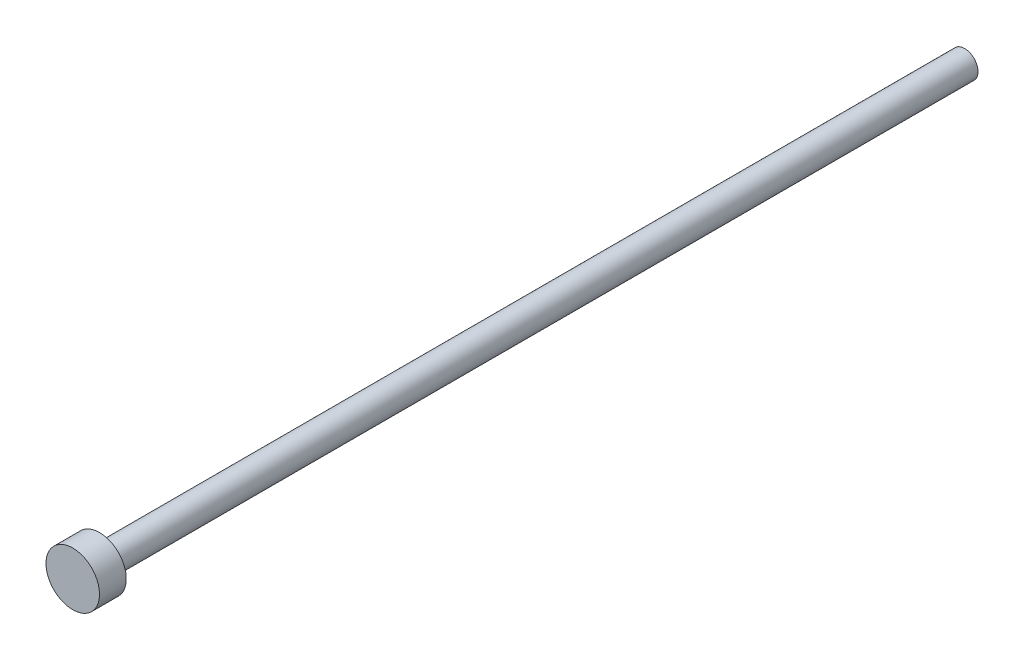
ISO-10303-21;
HEADER;
FILE_DESCRIPTION(('STEP AP214'),'2;1');
FILE_NAME('part.step','',(''),(''),'','','');
FILE_SCHEMA(('AUTOMOTIVE_DESIGN { 1 0 10303 214 1 1 1 1 }'));
ENDSEC;
DATA;
#1=APPLICATION_CONTEXT('core data for automotive mechanical design processes');
#2=APPLICATION_PROTOCOL_DEFINITION('international standard','automotive_design',2000,#1);
#3=PRODUCT_CONTEXT('',#1,'mechanical');
#4=PRODUCT('Part','Part','',(#3));
#5=PRODUCT_RELATED_PRODUCT_CATEGORY('part','',(#4));
#6=PRODUCT_DEFINITION_FORMATION('','',#4);
#7=PRODUCT_DEFINITION_CONTEXT('part definition',#1,'design');
#8=PRODUCT_DEFINITION('design','',#6,#7);
#9=PRODUCT_DEFINITION_SHAPE('','',#8);
#10=(LENGTH_UNIT() NAMED_UNIT(*) SI_UNIT(.MILLI.,.METRE.));
#11=(NAMED_UNIT(*) PLANE_ANGLE_UNIT() SI_UNIT($,.RADIAN.));
#12=(NAMED_UNIT(*) SI_UNIT($,.STERADIAN.) SOLID_ANGLE_UNIT());
#13=UNCERTAINTY_MEASURE_WITH_UNIT(LENGTH_MEASURE(1.E-05),#10,'distance_accuracy_value','');
#14=(GEOMETRIC_REPRESENTATION_CONTEXT(3) GLOBAL_UNCERTAINTY_ASSIGNED_CONTEXT((#13)) GLOBAL_UNIT_ASSIGNED_CONTEXT((#10,
#11,#12)) REPRESENTATION_CONTEXT('',''));
#15=CARTESIAN_POINT('',(0.,0.,0.));
#16=DIRECTION('',(0.,0.,1.));
#17=DIRECTION('',(1.,0.,0.));
#18=AXIS2_PLACEMENT_3D('',#15,#16,#17);
#19=CARTESIAN_POINT('',(0.,1.50000000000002,-100.));
#20=DIRECTION('',(0.,0.,-1.));
#21=DIRECTION('',(-1.,0.,0.));
#22=AXIS2_PLACEMENT_3D('',#19,#20,#21);
#23=PLANE('',#22);
#24=CARTESIAN_POINT('',(0.,0.,-100.));
#25=DIRECTION('',(0.,0.,-1.));
#26=DIRECTION('',(-1.,0.,0.));
#27=AXIS2_PLACEMENT_3D('',#24,#25,#26);
#28=CIRCLE('',#27,1.50000000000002);
#29=CARTESIAN_POINT('',(-1.50000000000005,0.,-100.));
#30=VERTEX_POINT('',#29);
#31=EDGE_CURVE('E10',#30,#30,#28,.T.);
#32=ORIENTED_EDGE('',*,*,#31,.T.);
#33=EDGE_LOOP('',(#32));
#34=FACE_BOUND('',#33,.T.);
#35=ADVANCED_FACE('F32',(#34),#23,.T.);
#36=CARTESIAN_POINT('',(0.,0.,0.));
#37=DIRECTION('',(0.,0.,-1.));
#38=DIRECTION('',(-1.,0.,0.));
#39=AXIS2_PLACEMENT_3D('',#36,#37,#38);
#40=CYLINDRICAL_SURFACE('',#39,1.50000000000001);
#41=CARTESIAN_POINT('',(0.,0.,-3.3));
#42=DIRECTION('',(0.,0.,-1.));
#43=DIRECTION('',(-1.,0.,0.));
#44=AXIS2_PLACEMENT_3D('',#41,#42,#43);
#45=CIRCLE('',#44,1.5);
#46=CARTESIAN_POINT('',(-1.50000000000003,0.,-3.3));
#47=VERTEX_POINT('',#46);
#48=EDGE_CURVE('E38',#47,#47,#45,.T.);
#49=ORIENTED_EDGE('',*,*,#48,.T.);
#50=EDGE_LOOP('',(#49));
#51=FACE_BOUND('',#50,.T.);
#52=ORIENTED_EDGE('',*,*,#31,.F.);
#53=EDGE_LOOP('',(#52));
#54=FACE_BOUND('',#53,.T.);
#55=ADVANCED_FACE('F67',(#51,#54),#40,.T.);
#56=CARTESIAN_POINT('',(0.,0.,-3.3));
#57=DIRECTION('',(0.,0.,-1.));
#58=DIRECTION('',(-1.,0.,0.));
#59=AXIS2_PLACEMENT_3D('',#56,#57,#58);
#60=TOROIDAL_SURFACE('',#59,1.8,0.300000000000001);
#61=CARTESIAN_POINT('',(0.,0.,-3.));
#62=DIRECTION('',(0.,0.,-1.));
#63=DIRECTION('',(-1.,0.,0.));
#64=AXIS2_PLACEMENT_3D('',#61,#62,#63);
#65=CIRCLE('',#64,1.8);
#66=CARTESIAN_POINT('',(-1.80000000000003,0.,-3.));
#67=VERTEX_POINT('',#66);
#68=EDGE_CURVE('E42',#67,#67,#65,.T.);
#69=ORIENTED_EDGE('',*,*,#68,.T.);
#70=EDGE_LOOP('',(#69));
#71=FACE_BOUND('',#70,.T.);
#72=ORIENTED_EDGE('',*,*,#48,.F.);
#73=EDGE_LOOP('',(#72));
#74=FACE_BOUND('',#73,.T.);
#75=ADVANCED_FACE('F71',(#71,#74),#60,.F.);
#76=CARTESIAN_POINT('',(0.,3.,-3.));
#77=DIRECTION('',(0.,0.,-1.));
#78=DIRECTION('',(-1.,0.,0.));
#79=AXIS2_PLACEMENT_3D('',#76,#77,#78);
#80=PLANE('',#79);
#81=CARTESIAN_POINT('',(0.,0.,-3.));
#82=DIRECTION('',(0.,0.,-1.));
#83=DIRECTION('',(-1.,0.,0.));
#84=AXIS2_PLACEMENT_3D('',#81,#82,#83);
#85=CIRCLE('',#84,3.);
#86=CARTESIAN_POINT('',(-3.00000000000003,0.,-3.));
#87=VERTEX_POINT('',#86);
#88=EDGE_CURVE('E46',#87,#87,#85,.T.);
#89=ORIENTED_EDGE('',*,*,#88,.T.);
#90=EDGE_LOOP('',(#89));
#91=FACE_BOUND('',#90,.T.);
#92=ORIENTED_EDGE('',*,*,#68,.F.);
#93=EDGE_LOOP('',(#92));
#94=FACE_BOUND('',#93,.T.);
#95=ADVANCED_FACE('F64',(#91,#94),#80,.T.);
#96=CARTESIAN_POINT('',(0.,0.,0.));
#97=DIRECTION('',(0.,0.,-1.));
#98=DIRECTION('',(-1.,0.,0.));
#99=AXIS2_PLACEMENT_3D('',#96,#97,#98);
#100=CYLINDRICAL_SURFACE('',#99,3.);
#101=CARTESIAN_POINT('',(0.,0.,0.));
#102=DIRECTION('',(0.,0.,-1.));
#103=DIRECTION('',(-1.,0.,0.));
#104=AXIS2_PLACEMENT_3D('',#101,#102,#103);
#105=CIRCLE('',#104,3.);
#106=CARTESIAN_POINT('',(-3.00000000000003,0.,0.));
#107=VERTEX_POINT('',#106);
#108=EDGE_CURVE('E51',#107,#107,#105,.T.);
#109=ORIENTED_EDGE('',*,*,#108,.T.);
#110=EDGE_LOOP('',(#109));
#111=FACE_BOUND('',#110,.T.);
#112=ORIENTED_EDGE('',*,*,#88,.F.);
#113=EDGE_LOOP('',(#112));
#114=FACE_BOUND('',#113,.T.);
#115=ADVANCED_FACE('F55',(#111,#114),#100,.T.);
#116=CARTESIAN_POINT('',(0.,0.,0.));
#117=DIRECTION('',(0.,0.,1.));
#118=DIRECTION('',(1.,0.,0.));
#119=AXIS2_PLACEMENT_3D('',#116,#117,#118);
#120=PLANE('',#119);
#121=ORIENTED_EDGE('',*,*,#108,.F.);
#122=EDGE_LOOP('',(#121));
#123=FACE_BOUND('',#122,.T.);
#124=ADVANCED_FACE('F58',(#123),#120,.T.);
#125=CLOSED_SHELL('',(#35,#55,#75,#95,#115,#124));
#126=MANIFOLD_SOLID_BREP('B2',#125);
#127=ADVANCED_BREP_SHAPE_REPRESENTATION('',(#18,#126),#14);
#128=SHAPE_DEFINITION_REPRESENTATION(#9,#127);
ENDSEC;
END-ISO-10303-21;
